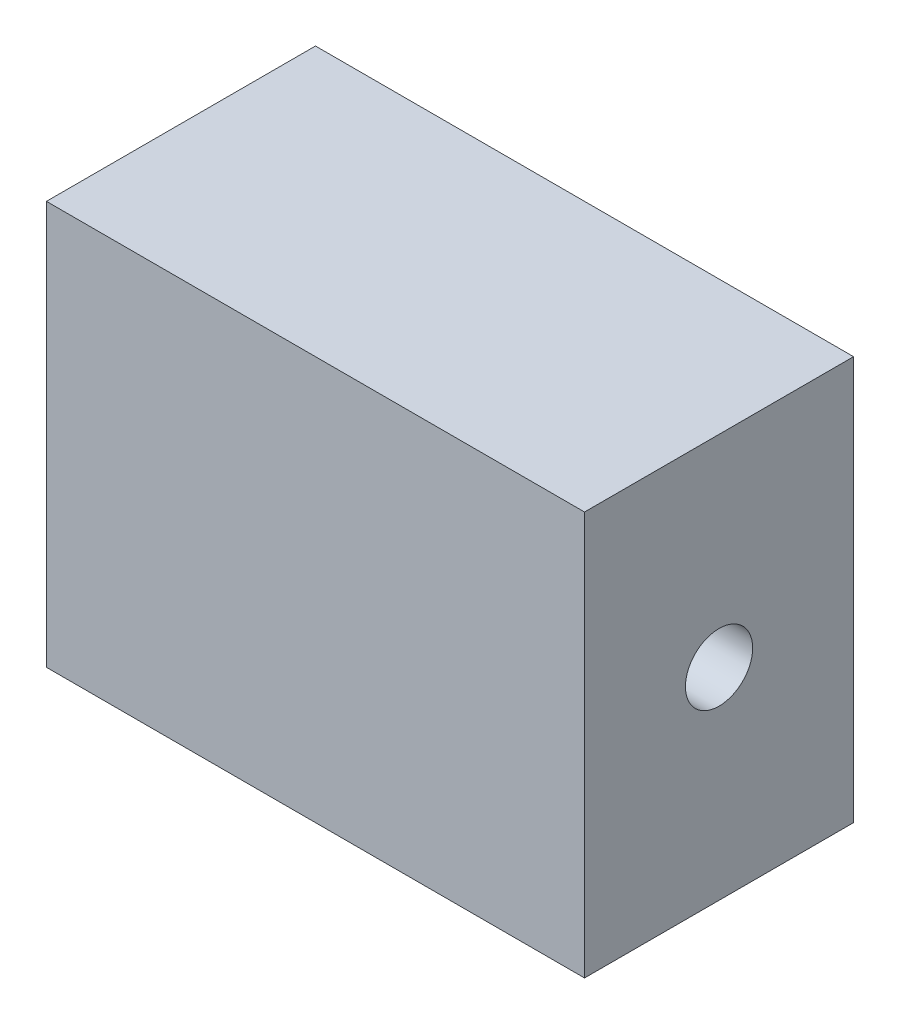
ISO-10303-21;
HEADER;
FILE_DESCRIPTION(('STEP AP214'),'2;1');
FILE_NAME('part.step','',(''),(''),'','','');
FILE_SCHEMA(('AUTOMOTIVE_DESIGN { 1 0 10303 214 1 1 1 1 }'));
ENDSEC;
DATA;
#1=APPLICATION_CONTEXT('core data for automotive mechanical design processes');
#2=APPLICATION_PROTOCOL_DEFINITION('international standard','automotive_design',2000,#1);
#3=PRODUCT_CONTEXT('',#1,'mechanical');
#4=PRODUCT('Part','Part','',(#3));
#5=PRODUCT_RELATED_PRODUCT_CATEGORY('part','',(#4));
#6=PRODUCT_DEFINITION_FORMATION('','',#4);
#7=PRODUCT_DEFINITION_CONTEXT('part definition',#1,'design');
#8=PRODUCT_DEFINITION('design','',#6,#7);
#9=PRODUCT_DEFINITION_SHAPE('','',#8);
#10=(LENGTH_UNIT() NAMED_UNIT(*) SI_UNIT(.MILLI.,.METRE.));
#11=(NAMED_UNIT(*) PLANE_ANGLE_UNIT() SI_UNIT($,.RADIAN.));
#12=(NAMED_UNIT(*) SI_UNIT($,.STERADIAN.) SOLID_ANGLE_UNIT());
#13=UNCERTAINTY_MEASURE_WITH_UNIT(LENGTH_MEASURE(1.E-05),#10,'distance_accuracy_value','');
#14=(GEOMETRIC_REPRESENTATION_CONTEXT(3) GLOBAL_UNCERTAINTY_ASSIGNED_CONTEXT((#13)) GLOBAL_UNIT_ASSIGNED_CONTEXT((#10,
#11,#12)) REPRESENTATION_CONTEXT('',''));
#15=CARTESIAN_POINT('',(0.,0.,0.));
#16=DIRECTION('',(0.,0.,1.));
#17=DIRECTION('',(1.,0.,0.));
#18=AXIS2_PLACEMENT_3D('',#15,#16,#17);
#19=CARTESIAN_POINT('',(0.,0.,20.));
#20=DIRECTION('',(1.,0.,0.));
#21=DIRECTION('',(0.,0.,-1.));
#22=AXIS2_PLACEMENT_3D('',#19,#20,#21);
#23=PLANE('',#22);
#24=DIRECTION('',(0.,-1.,0.));
#25=VECTOR('',#24,1.);
#26=CARTESIAN_POINT('',(0.,0.,0.));
#27=LINE('',#26,#25);
#28=CARTESIAN_POINT('',(0.,30.,0.));
#29=VERTEX_POINT('',#28);
#30=CARTESIAN_POINT('',(0.,0.,0.));
#31=VERTEX_POINT('',#30);
#32=EDGE_CURVE('E107',#29,#31,#27,.T.);
#33=ORIENTED_EDGE('',*,*,#32,.T.);
#34=DIRECTION('',(0.,0.,-1.));
#35=VECTOR('',#34,1.);
#36=CARTESIAN_POINT('',(0.,0.,20.));
#37=LINE('',#36,#35);
#38=CARTESIAN_POINT('',(0.,0.,20.));
#39=VERTEX_POINT('',#38);
#40=EDGE_CURVE('E11',#39,#31,#37,.T.);
#41=ORIENTED_EDGE('',*,*,#40,.F.);
#42=DIRECTION('',(0.,-1.,0.));
#43=VECTOR('',#42,1.);
#44=CARTESIAN_POINT('',(0.,0.,20.));
#45=LINE('',#44,#43);
#46=CARTESIAN_POINT('',(0.,30.,20.));
#47=VERTEX_POINT('',#46);
#48=EDGE_CURVE('E91',#47,#39,#45,.T.);
#49=ORIENTED_EDGE('',*,*,#48,.F.);
#50=DIRECTION('',(0.,0.,-1.));
#51=VECTOR('',#50,1.);
#52=CARTESIAN_POINT('',(0.,30.,20.));
#53=LINE('',#52,#51);
#54=EDGE_CURVE('E103',#47,#29,#53,.T.);
#55=ORIENTED_EDGE('',*,*,#54,.T.);
#56=EDGE_LOOP('',(#33,#41,#49,#55));
#57=FACE_BOUND('',#56,.T.);
#58=ADVANCED_FACE('F39',(#57),#23,.F.);
#59=CARTESIAN_POINT('',(0.,0.,20.));
#60=DIRECTION('',(0.,1.,0.));
#61=DIRECTION('',(0.,0.,1.));
#62=AXIS2_PLACEMENT_3D('',#59,#60,#61);
#63=PLANE('',#62);
#64=DIRECTION('',(1.,0.,0.));
#65=VECTOR('',#64,1.);
#66=CARTESIAN_POINT('',(0.,0.,0.));
#67=LINE('',#66,#65);
#68=CARTESIAN_POINT('',(40.,0.,0.));
#69=VERTEX_POINT('',#68);
#70=EDGE_CURVE('E96',#31,#69,#67,.T.);
#71=ORIENTED_EDGE('',*,*,#70,.T.);
#72=DIRECTION('',(0.,0.,-1.));
#73=VECTOR('',#72,1.);
#74=CARTESIAN_POINT('',(40.,0.,20.));
#75=LINE('',#74,#73);
#76=CARTESIAN_POINT('',(40.,0.,20.));
#77=VERTEX_POINT('',#76);
#78=EDGE_CURVE('E48',#77,#69,#75,.T.);
#79=ORIENTED_EDGE('',*,*,#78,.F.);
#80=DIRECTION('',(1.,0.,0.));
#81=VECTOR('',#80,1.);
#82=CARTESIAN_POINT('',(0.,0.,20.));
#83=LINE('',#82,#81);
#84=EDGE_CURVE('E86',#39,#77,#83,.T.);
#85=ORIENTED_EDGE('',*,*,#84,.F.);
#86=ORIENTED_EDGE('',*,*,#40,.T.);
#87=EDGE_LOOP('',(#71,#79,#85,#86));
#88=FACE_BOUND('',#87,.T.);
#89=ADVANCED_FACE('F95',(#88),#63,.F.);
#90=CARTESIAN_POINT('',(40.,0.,20.));
#91=DIRECTION('',(-1.,0.,0.));
#92=DIRECTION('',(0.,0.,1.));
#93=AXIS2_PLACEMENT_3D('',#90,#91,#92);
#94=PLANE('',#93);
#95=CARTESIAN_POINT('',(40.,15.,10.));
#96=DIRECTION('',(1.,0.,0.));
#97=DIRECTION('',(0.,0.,-1.));
#98=AXIS2_PLACEMENT_3D('',#95,#96,#97);
#99=CIRCLE('',#98,2.5);
#100=CARTESIAN_POINT('',(40.,15.,7.5));
#101=VERTEX_POINT('',#100);
#102=EDGE_CURVE('E128',#101,#101,#99,.T.);
#103=ORIENTED_EDGE('',*,*,#102,.F.);
#104=EDGE_LOOP('',(#103));
#105=FACE_BOUND('',#104,.T.);
#106=DIRECTION('',(0.,1.,0.));
#107=VECTOR('',#106,1.);
#108=CARTESIAN_POINT('',(40.,0.,0.));
#109=LINE('',#108,#107);
#110=CARTESIAN_POINT('',(40.,30.,0.));
#111=VERTEX_POINT('',#110);
#112=EDGE_CURVE('E73',#69,#111,#109,.T.);
#113=ORIENTED_EDGE('',*,*,#112,.T.);
#114=DIRECTION('',(0.,0.,-1.));
#115=VECTOR('',#114,1.);
#116=CARTESIAN_POINT('',(40.,30.,20.));
#117=LINE('',#116,#115);
#118=CARTESIAN_POINT('',(40.,30.,20.));
#119=VERTEX_POINT('',#118);
#120=EDGE_CURVE('E98',#119,#111,#117,.T.);
#121=ORIENTED_EDGE('',*,*,#120,.F.);
#122=DIRECTION('',(0.,1.,0.));
#123=VECTOR('',#122,1.);
#124=CARTESIAN_POINT('',(40.,0.,20.));
#125=LINE('',#124,#123);
#126=EDGE_CURVE('E89',#77,#119,#125,.T.);
#127=ORIENTED_EDGE('',*,*,#126,.F.);
#128=ORIENTED_EDGE('',*,*,#78,.T.);
#129=EDGE_LOOP('',(#113,#121,#127,#128));
#130=FACE_BOUND('',#129,.T.);
#131=ADVANCED_FACE('F99',(#105,#130),#94,.F.);
#132=CARTESIAN_POINT('',(0.,30.,20.));
#133=DIRECTION('',(0.,-1.,0.));
#134=DIRECTION('',(0.,0.,-1.));
#135=AXIS2_PLACEMENT_3D('',#132,#133,#134);
#136=PLANE('',#135);
#137=DIRECTION('',(-1.,0.,0.));
#138=VECTOR('',#137,1.);
#139=CARTESIAN_POINT('',(0.,30.,0.));
#140=LINE('',#139,#138);
#141=EDGE_CURVE('E79',#111,#29,#140,.T.);
#142=ORIENTED_EDGE('',*,*,#141,.T.);
#143=ORIENTED_EDGE('',*,*,#54,.F.);
#144=DIRECTION('',(-1.,0.,0.));
#145=VECTOR('',#144,1.);
#146=CARTESIAN_POINT('',(0.,30.,20.));
#147=LINE('',#146,#145);
#148=EDGE_CURVE('E56',#119,#47,#147,.T.);
#149=ORIENTED_EDGE('',*,*,#148,.F.);
#150=ORIENTED_EDGE('',*,*,#120,.T.);
#151=EDGE_LOOP('',(#142,#143,#149,#150));
#152=FACE_BOUND('',#151,.T.);
#153=ADVANCED_FACE('F121',(#152),#136,.F.);
#154=CARTESIAN_POINT('',(0.,0.,20.));
#155=DIRECTION('',(0.,0.,-1.));
#156=DIRECTION('',(-1.,0.,0.));
#157=AXIS2_PLACEMENT_3D('',#154,#155,#156);
#158=PLANE('',#157);
#159=ORIENTED_EDGE('',*,*,#48,.T.);
#160=ORIENTED_EDGE('',*,*,#84,.T.);
#161=ORIENTED_EDGE('',*,*,#126,.T.);
#162=ORIENTED_EDGE('',*,*,#148,.T.);
#163=EDGE_LOOP('',(#159,#160,#161,#162));
#164=FACE_BOUND('',#163,.T.);
#165=ADVANCED_FACE('F87',(#164),#158,.F.);
#166=CARTESIAN_POINT('',(0.,0.,0.));
#167=DIRECTION('',(0.,0.,-1.));
#168=DIRECTION('',(-1.,0.,0.));
#169=AXIS2_PLACEMENT_3D('',#166,#167,#168);
#170=PLANE('',#169);
#171=ORIENTED_EDGE('',*,*,#32,.F.);
#172=ORIENTED_EDGE('',*,*,#141,.F.);
#173=ORIENTED_EDGE('',*,*,#112,.F.);
#174=ORIENTED_EDGE('',*,*,#70,.F.);
#175=EDGE_LOOP('',(#171,#172,#173,#174));
#176=FACE_BOUND('',#175,.T.);
#177=ADVANCED_FACE('F124',(#176),#170,.T.);
#178=CARTESIAN_POINT('',(20.,15.,10.));
#179=DIRECTION('',(1.,0.,0.));
#180=DIRECTION('',(0.,0.,-1.));
#181=AXIS2_PLACEMENT_3D('',#178,#179,#180);
#182=CYLINDRICAL_SURFACE('',#181,2.5);
#183=CARTESIAN_POINT('',(20.,15.,10.));
#184=DIRECTION('',(1.,0.,0.));
#185=DIRECTION('',(0.,0.,-1.));
#186=AXIS2_PLACEMENT_3D('',#183,#184,#185);
#187=CIRCLE('',#186,2.5);
#188=CARTESIAN_POINT('',(20.,15.,7.5));
#189=VERTEX_POINT('',#188);
#190=EDGE_CURVE('E111',#189,#189,#187,.T.);
#191=ORIENTED_EDGE('',*,*,#190,.F.);
#192=EDGE_LOOP('',(#191));
#193=FACE_BOUND('',#192,.T.);
#194=ORIENTED_EDGE('',*,*,#102,.T.);
#195=EDGE_LOOP('',(#194));
#196=FACE_BOUND('',#195,.T.);
#197=ADVANCED_FACE('F138',(#193,#196),#182,.F.);
#198=CARTESIAN_POINT('',(20.,15.,10.));
#199=DIRECTION('',(1.,0.,0.));
#200=DIRECTION('',(0.,0.,-1.));
#201=AXIS2_PLACEMENT_3D('',#198,#199,#200);
#202=PLANE('',#201);
#203=ORIENTED_EDGE('',*,*,#190,.T.);
#204=EDGE_LOOP('',(#203));
#205=FACE_BOUND('',#204,.T.);
#206=ADVANCED_FACE('F136',(#205),#202,.T.);
#207=CLOSED_SHELL('',(#58,#89,#131,#153,#165,#177,#197,#206));
#208=MANIFOLD_SOLID_BREP('B2',#207);
#209=ADVANCED_BREP_SHAPE_REPRESENTATION('',(#18,#208),#14);
#210=SHAPE_DEFINITION_REPRESENTATION(#9,#209);
ENDSEC;
END-ISO-10303-21;
